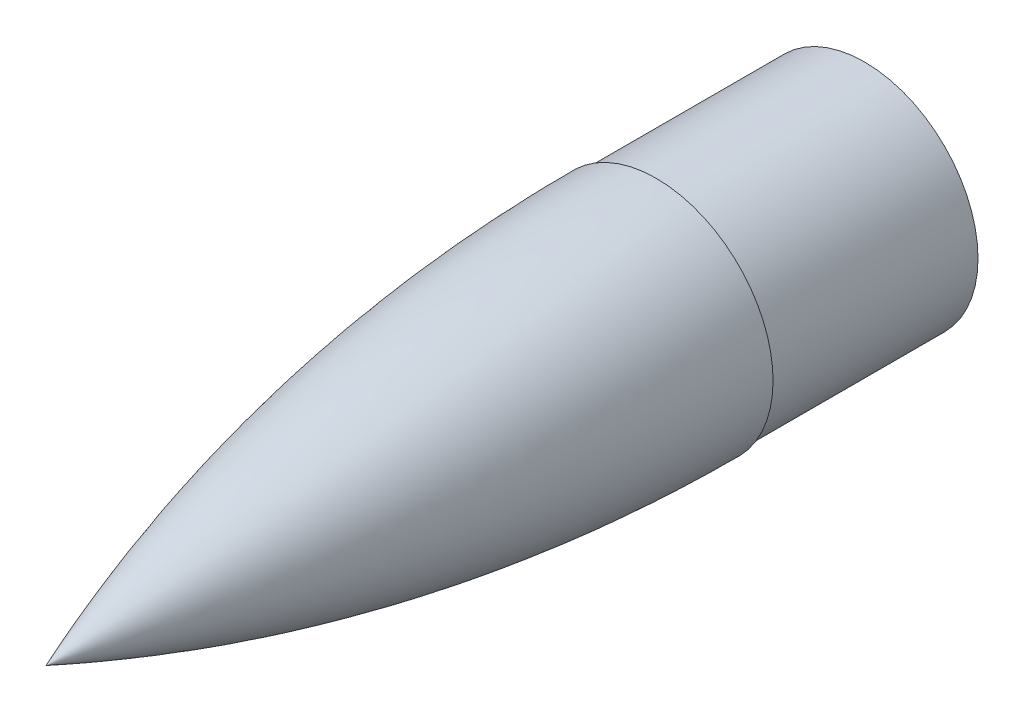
ISO-10303-21;
HEADER;
FILE_DESCRIPTION(('STEP AP214'),'2;1');
FILE_NAME('part.step','',(''),(''),'','','');
FILE_SCHEMA(('AUTOMOTIVE_DESIGN { 1 0 10303 214 1 1 1 1 }'));
ENDSEC;
DATA;
#1=APPLICATION_CONTEXT('core data for automotive mechanical design processes');
#2=APPLICATION_PROTOCOL_DEFINITION('international standard','automotive_design',2000,#1);
#3=PRODUCT_CONTEXT('',#1,'mechanical');
#4=PRODUCT('Part','Part','',(#3));
#5=PRODUCT_RELATED_PRODUCT_CATEGORY('part','',(#4));
#6=PRODUCT_DEFINITION_FORMATION('','',#4);
#7=PRODUCT_DEFINITION_CONTEXT('part definition',#1,'design');
#8=PRODUCT_DEFINITION('design','',#6,#7);
#9=PRODUCT_DEFINITION_SHAPE('','',#8);
#10=(LENGTH_UNIT() NAMED_UNIT(*) SI_UNIT(.MILLI.,.METRE.));
#11=(NAMED_UNIT(*) PLANE_ANGLE_UNIT() SI_UNIT($,.RADIAN.));
#12=(NAMED_UNIT(*) SI_UNIT($,.STERADIAN.) SOLID_ANGLE_UNIT());
#13=UNCERTAINTY_MEASURE_WITH_UNIT(LENGTH_MEASURE(1.E-05),#10,'distance_accuracy_value','');
#14=(GEOMETRIC_REPRESENTATION_CONTEXT(3) GLOBAL_UNCERTAINTY_ASSIGNED_CONTEXT((#13)) GLOBAL_UNIT_ASSIGNED_CONTEXT((#10,
#11,#12)) REPRESENTATION_CONTEXT('',''));
#15=CARTESIAN_POINT('',(0.,0.,0.));
#16=DIRECTION('',(0.,0.,1.));
#17=DIRECTION('',(1.,0.,0.));
#18=AXIS2_PLACEMENT_3D('',#15,#16,#17);
#19=CARTESIAN_POINT('',(0.,-2.89930853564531E-13,-410.000000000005));
#20=DIRECTION('',(0.,0.,1.));
#21=DIRECTION('',(1.,0.,0.));
#22=AXIS2_PLACEMENT_3D('',#19,#20,#21);
#23=PLANE('',#22);
#24=CARTESIAN_POINT('',(0.,0.,-410.000000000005));
#25=DIRECTION('',(0.,0.,-1.));
#26=DIRECTION('',(0.,1.,0.));
#27=AXIS2_PLACEMENT_3D('',#24,#25,#26);
#28=CIRCLE('',#27,76.2);
#29=CARTESIAN_POINT('',(0.,76.2,-410.000000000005));
#30=VERTEX_POINT('',#29);
#31=EDGE_CURVE('E50',#30,#30,#28,.T.);
#32=ORIENTED_EDGE('',*,*,#31,.F.);
#33=EDGE_LOOP('',(#32));
#34=FACE_BOUND('',#33,.T.);
#35=CARTESIAN_POINT('',(0.,0.,-410.000000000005));
#36=DIRECTION('',(0.,0.,1.));
#37=DIRECTION('',(1.,0.,0.));
#38=AXIS2_PLACEMENT_3D('',#35,#36,#37);
#39=CIRCLE('',#38,78.5000000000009);
#40=CARTESIAN_POINT('',(78.5000000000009,0.,-410.000000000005));
#41=VERTEX_POINT('',#40);
#42=EDGE_CURVE('E86',#41,#41,#39,.T.);
#43=ORIENTED_EDGE('',*,*,#42,.F.);
#44=EDGE_LOOP('',(#43));
#45=FACE_BOUND('',#44,.T.);
#46=ADVANCED_FACE('F41',(#34,#45),#23,.F.);
#47=CARTESIAN_POINT('',(0.,-3.56686840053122E-13,1.11028250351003E-12));
#48=CARTESIAN_POINT('',(0.,0.192741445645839,-0.484886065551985));
#49=CARTESIAN_POINT('',(0.,0.58085868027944,-1.46382552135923));
#50=CARTESIAN_POINT('',(0.,1.4389329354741,-3.63394155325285));
#51=CARTESIAN_POINT('',(0.,2.27554858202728,-5.76912351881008));
#52=CARTESIAN_POINT('',(0.,3.2058810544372,-8.15531190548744));
#53=CARTESIAN_POINT('',(0.,4.1014719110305,-10.469339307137));
#54=CARTESIAN_POINT('',(0.,5.00086785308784,-12.8081786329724));
#55=CARTESIAN_POINT('',(0.,5.89191282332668,-15.1412480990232));
#56=CARTESIAN_POINT('',(0.,6.77885431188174,-17.4792327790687));
#57=CARTESIAN_POINT('',(0.,7.66008012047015,-19.81807626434));
#58=CARTESIAN_POINT('',(0.,8.53621015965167,-22.1593374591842));
#59=CARTESIAN_POINT('',(0.,9.40699944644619,-24.5023993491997));
#60=CARTESIAN_POINT('',(0.,10.4889158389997,-27.4337426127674));
#61=CARTESIAN_POINT('',(0.,11.7766377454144,-30.9552136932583));
#62=CARTESIAN_POINT('',(0.,15.3877231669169,-40.946380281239));
#63=CARTESIAN_POINT('',(0.,21.1375700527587,-57.4733895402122));
#64=CARTESIAN_POINT('',(0.,30.8279263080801,-87.182890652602));
#65=CARTESIAN_POINT('',(0.,44.6122994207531,-135.253521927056));
#66=CARTESIAN_POINT('',(0.,58.1939516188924,-193.729566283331));
#67=CARTESIAN_POINT('',(0.,67.6529694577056,-250.483348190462));
#68=CARTESIAN_POINT('',(0.,72.9196296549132,-296.440753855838));
#69=CARTESIAN_POINT('',(0.,75.18769803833,-323.844768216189));
#70=CARTESIAN_POINT('',(0.,75.9808066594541,-335.065539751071));
#71=CARTESIAN_POINT('',(0.,76.4533708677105,-342.549719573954));
#72=CARTESIAN_POINT('',(0.,76.7459373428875,-347.540550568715));
#73=CARTESIAN_POINT('',(0.,77.0160215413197,-352.532632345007));
#74=CARTESIAN_POINT('',(0.,77.2636179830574,-357.525907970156));
#75=CARTESIAN_POINT('',(0.,77.4887216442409,-362.520201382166));
#76=CARTESIAN_POINT('',(0.,77.6913279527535,-367.515535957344));
#77=CARTESIAN_POINT('',(0.,77.8714327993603,-372.511602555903));
#78=CARTESIAN_POINT('',(0.,78.0290325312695,-377.508646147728));
#79=CARTESIAN_POINT('',(0.,78.1641239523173,-382.505984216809));
#80=CARTESIAN_POINT('',(0.,78.2767043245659,-387.5045115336));
#81=CARTESIAN_POINT('',(0.,78.3555129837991,-391.877588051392));
#82=CARTESIAN_POINT('',(0.,78.408991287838,-395.627835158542));
#83=CARTESIAN_POINT('',(0.,78.4406564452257,-398.438374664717));
#84=CARTESIAN_POINT('',(0.,78.4582483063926,-400.312639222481));
#85=CARTESIAN_POINT('',(0.,78.4705626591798,-401.881505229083));
#86=CARTESIAN_POINT('',(0.,78.4790068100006,-403.131072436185));
#87=CARTESIAN_POINT('',(0.,78.4878028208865,-404.675846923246));
#88=CARTESIAN_POINT('',(0.,78.4955433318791,-406.459759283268));
#89=CARTESIAN_POINT('',(0.,78.4990617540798,-408.431807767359));
#90=CARTESIAN_POINT('',(0.,78.5000000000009,-409.478211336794));
#91=CARTESIAN_POINT('',(0.,78.5000000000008,-410.000000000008));
#92=B_SPLINE_CURVE_WITH_KNOTS('',4,(#47,#48,#49,#50,#51,#52,#53,#54,#55,#56,#57,#58,#59,#60,#61,
#62,#63,#64,#65,#66,#67,#68,#69,#70,#71,#72,#73,#74,#75,#76,#77,#78,#79,#80,#81,#82,#83,#84,#85,
#86,#87,#88,#89,#90,#91),.UNSPECIFIED.,.F.,.F.,(5,1,1,1,1,1,1,1,1,1,1,1,1,1,1,1,1,1,1,1,1,1,1,1,
1,1,1,1,1,1,1,1,1,1,1,1,1,1,1,1,1,5),(0.0834966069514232,0.0884666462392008,0.0934366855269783,
0.0984067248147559,0.103376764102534,0.108346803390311,0.113316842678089,0.118286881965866,
0.123256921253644,0.128226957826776,0.133196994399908,0.13816703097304,0.143137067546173,
0.153077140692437,0.163017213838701,0.22265763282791,0.282298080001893,0.401578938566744,
0.560620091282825,0.699781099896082,0.739541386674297,0.769361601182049,0.77930167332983,
0.789241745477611,0.799181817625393,0.80912189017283,0.819061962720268,0.829002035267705,
0.838942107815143,0.848882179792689,0.858822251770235,0.868762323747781,0.878702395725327,
0.888642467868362,0.89361250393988,0.898582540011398,0.901067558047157,0.903552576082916,
0.906037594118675,0.908522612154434,0.913492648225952,0.918462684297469),.UNSPECIFIED.);
#93=CARTESIAN_POINT('',(0.,0.,0.));
#94=DIRECTION('',(0.,0.,1.));
#95=AXIS1_PLACEMENT('',#93,#94);
#96=SURFACE_OF_REVOLUTION('',#92,#95);
#97=ORIENTED_EDGE('',*,*,#42,.T.);
#98=EDGE_LOOP('',(#97));
#99=FACE_BOUND('',#98,.T.);
#100=CARTESIAN_POINT('',(0.,0.,0.));
#101=VERTEX_POINT('',#100);
#102=VERTEX_LOOP('',#101);
#103=FACE_BOUND('',#102,.T.);
#104=ADVANCED_FACE('F43',(#99,#103),#96,.F.);
#105=CARTESIAN_POINT('',(0.,0.,-550.000000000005));
#106=DIRECTION('',(0.,0.,1.));
#107=DIRECTION('',(0.,-1.,0.));
#108=AXIS2_PLACEMENT_3D('',#105,#106,#107);
#109=CYLINDRICAL_SURFACE('',#108,76.2);
#110=CARTESIAN_POINT('',(0.,0.,-550.000000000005));
#111=DIRECTION('',(0.,0.,-1.));
#112=DIRECTION('',(0.,1.,0.));
#113=AXIS2_PLACEMENT_3D('',#110,#111,#112);
#114=CIRCLE('',#113,76.2);
#115=CARTESIAN_POINT('',(0.,76.2000000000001,-550.000000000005));
#116=VERTEX_POINT('',#115);
#117=EDGE_CURVE('E88',#116,#116,#114,.T.);
#118=ORIENTED_EDGE('',*,*,#117,.F.);
#119=EDGE_LOOP('',(#118));
#120=FACE_BOUND('',#119,.T.);
#121=ORIENTED_EDGE('',*,*,#31,.T.);
#122=EDGE_LOOP('',(#121));
#123=FACE_BOUND('',#122,.T.);
#124=ADVANCED_FACE('F70',(#120,#123),#109,.T.);
#125=CARTESIAN_POINT('',(0.,0.,-550.000000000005));
#126=DIRECTION('',(0.,0.,-1.));
#127=DIRECTION('',(0.,1.,0.));
#128=AXIS2_PLACEMENT_3D('',#125,#126,#127);
#129=PLANE('',#128);
#130=CARTESIAN_POINT('',(0.,0.,-550.000000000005));
#131=DIRECTION('',(0.,0.,-1.));
#132=DIRECTION('',(0.,1.,0.));
#133=AXIS2_PLACEMENT_3D('',#130,#131,#132);
#134=CIRCLE('',#133,73.02);
#135=CARTESIAN_POINT('',(0.,73.0200000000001,-550.000000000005));
#136=VERTEX_POINT('',#135);
#137=EDGE_CURVE('E92',#136,#136,#134,.T.);
#138=ORIENTED_EDGE('',*,*,#137,.F.);
#139=EDGE_LOOP('',(#138));
#140=FACE_BOUND('',#139,.T.);
#141=ORIENTED_EDGE('',*,*,#117,.T.);
#142=EDGE_LOOP('',(#141));
#143=FACE_BOUND('',#142,.T.);
#144=ADVANCED_FACE('F64',(#140,#143),#129,.T.);
#145=CARTESIAN_POINT('',(0.,0.,-550.000000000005));
#146=DIRECTION('',(0.,0.,1.));
#147=DIRECTION('',(0.,-1.,0.));
#148=AXIS2_PLACEMENT_3D('',#145,#146,#147);
#149=CYLINDRICAL_SURFACE('',#148,73.02);
#150=ORIENTED_EDGE('',*,*,#137,.T.);
#151=EDGE_LOOP('',(#150));
#152=FACE_BOUND('',#151,.T.);
#153=CARTESIAN_POINT('',(0.,0.,-338.684819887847));
#154=DIRECTION('',(0.,0.,1.));
#155=DIRECTION('',(1.,0.,0.));
#156=AXIS2_PLACEMENT_3D('',#153,#154,#155);
#157=CIRCLE('',#156,73.02);
#158=CARTESIAN_POINT('',(73.02,0.,-338.684819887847));
#159=VERTEX_POINT('',#158);
#160=EDGE_CURVE('E11',#159,#159,#157,.T.);
#161=ORIENTED_EDGE('',*,*,#160,.T.);
#162=EDGE_LOOP('',(#161));
#163=FACE_BOUND('',#162,.T.);
#164=ADVANCED_FACE('F59',(#152,#163),#149,.F.);
#165=CARTESIAN_POINT('',(0.,2.96353784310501,-7.53555187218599));
#166=CARTESIAN_POINT('',(0.,3.13653716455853,-7.98013667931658));
#167=CARTESIAN_POINT('',(0.,3.53807673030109,-9.01371199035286));
#168=CARTESIAN_POINT('',(0.,4.15584164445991,-10.6107253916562));
#169=CARTESIAN_POINT('',(0.,5.00086785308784,-12.8081786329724));
#170=CARTESIAN_POINT('',(0.,5.89191282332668,-15.1412480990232));
#171=CARTESIAN_POINT('',(0.,6.77885431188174,-17.4792327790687));
#172=CARTESIAN_POINT('',(0.,7.66008012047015,-19.81807626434));
#173=CARTESIAN_POINT('',(0.,8.53621015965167,-22.1593374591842));
#174=CARTESIAN_POINT('',(0.,9.40699944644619,-24.5023993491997));
#175=CARTESIAN_POINT('',(0.,10.4889158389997,-27.4337426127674));
#176=CARTESIAN_POINT('',(0.,11.7766377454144,-30.9552136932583));
#177=CARTESIAN_POINT('',(0.,15.3877231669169,-40.946380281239));
#178=CARTESIAN_POINT('',(0.,21.1375700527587,-57.4733895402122));
#179=CARTESIAN_POINT('',(0.,30.8279263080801,-87.182890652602));
#180=CARTESIAN_POINT('',(0.,44.6122994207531,-135.253521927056));
#181=CARTESIAN_POINT('',(0.,58.1939516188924,-193.729566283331));
#182=CARTESIAN_POINT('',(0.,67.6529694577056,-250.483348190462));
#183=CARTESIAN_POINT('',(0.,72.9196296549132,-296.440753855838));
#184=CARTESIAN_POINT('',(0.,75.18769803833,-323.844768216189));
#185=CARTESIAN_POINT('',(0.,75.9808066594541,-335.065539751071));
#186=CARTESIAN_POINT('',(0.,76.4533708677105,-342.549719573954));
#187=CARTESIAN_POINT('',(0.,76.7459373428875,-347.540550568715));
#188=CARTESIAN_POINT('',(0.,77.0160215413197,-352.532632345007));
#189=CARTESIAN_POINT('',(0.,77.2636179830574,-357.525907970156));
#190=CARTESIAN_POINT('',(0.,77.4887216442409,-362.520201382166));
#191=CARTESIAN_POINT('',(0.,77.6913279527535,-367.515535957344));
#192=CARTESIAN_POINT('',(0.,77.8714327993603,-372.511602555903));
#193=CARTESIAN_POINT('',(0.,78.0290325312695,-377.508646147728));
#194=CARTESIAN_POINT('',(0.,78.1641239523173,-382.505984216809));
#195=CARTESIAN_POINT('',(0.,78.2767043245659,-387.5045115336));
#196=CARTESIAN_POINT('',(0.,78.3555129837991,-391.877588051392));
#197=CARTESIAN_POINT('',(0.,78.408991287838,-395.627835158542));
#198=CARTESIAN_POINT('',(0.,78.4406564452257,-398.438374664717));
#199=CARTESIAN_POINT('',(0.,78.4582483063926,-400.312639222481));
#200=CARTESIAN_POINT('',(0.,78.4705626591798,-401.881505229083));
#201=CARTESIAN_POINT('',(0.,78.4790068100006,-403.131072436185));
#202=CARTESIAN_POINT('',(0.,78.4878028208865,-404.675846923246));
#203=CARTESIAN_POINT('',(0.,78.4955433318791,-406.459759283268));
#204=CARTESIAN_POINT('',(0.,78.4990617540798,-408.431807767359));
#205=CARTESIAN_POINT('',(0.,78.5000000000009,-409.478211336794));
#206=CARTESIAN_POINT('',(0.,78.5000000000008,-410.000000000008));
#207=B_SPLINE_CURVE_WITH_KNOTS('',4,(#165,#166,#167,#168,#169,#170,#171,#172,#173,#174,#175,
#176,#177,#178,#179,#180,#181,#182,#183,#184,#185,#186,#187,#188,#189,#190,#191,#192,#193,#194,
#195,#196,#197,#198,#199,#200,#201,#202,#203,#204,#205,#206),.UNSPECIFIED.,.F.,.F.,(5,1,1,1,1,1,
1,1,1,1,1,1,1,1,1,1,1,1,1,1,1,1,1,1,1,1,1,1,1,1,1,1,1,1,1,1,1,1,5),(0.0996085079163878,
0.103376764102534,0.108346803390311,0.113316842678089,0.118286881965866,0.123256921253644,
0.128226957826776,0.133196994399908,0.13816703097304,0.143137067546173,0.153077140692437,
0.163017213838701,0.22265763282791,0.282298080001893,0.401578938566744,0.560620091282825,
0.699781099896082,0.739541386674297,0.769361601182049,0.77930167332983,0.789241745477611,
0.799181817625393,0.80912189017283,0.819061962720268,0.829002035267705,0.838942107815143,
0.848882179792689,0.858822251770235,0.868762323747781,0.878702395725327,0.888642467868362,
0.89361250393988,0.898582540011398,0.901067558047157,0.903552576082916,0.906037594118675,
0.908522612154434,0.913492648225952,0.918462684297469),.UNSPECIFIED.);
#208=CARTESIAN_POINT('',(0.,0.,0.));
#209=DIRECTION('',(0.,0.,1.));
#210=AXIS1_PLACEMENT('',#208,#209);
#211=SURFACE_OF_REVOLUTION('',#207,#210);
#212=OFFSET_SURFACE('',#211,3.18,.F.);
#213=CARTESIAN_POINT('',(0.,0.,-8.68874025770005));
#214=VERTEX_POINT('',#213);
#215=VERTEX_LOOP('',#214);
#216=FACE_BOUND('',#215,.T.);
#217=ORIENTED_EDGE('',*,*,#160,.F.);
#218=EDGE_LOOP('',(#217));
#219=FACE_BOUND('',#218,.T.);
#220=ADVANCED_FACE('F56',(#216,#219),#212,.T.);
#221=CLOSED_SHELL('',(#46,#104,#124,#144,#164,#220));
#222=MANIFOLD_SOLID_BREP('B2',#221);
#223=ADVANCED_BREP_SHAPE_REPRESENTATION('',(#18,#222),#14);
#224=SHAPE_DEFINITION_REPRESENTATION(#9,#223);
ENDSEC;
END-ISO-10303-21;
